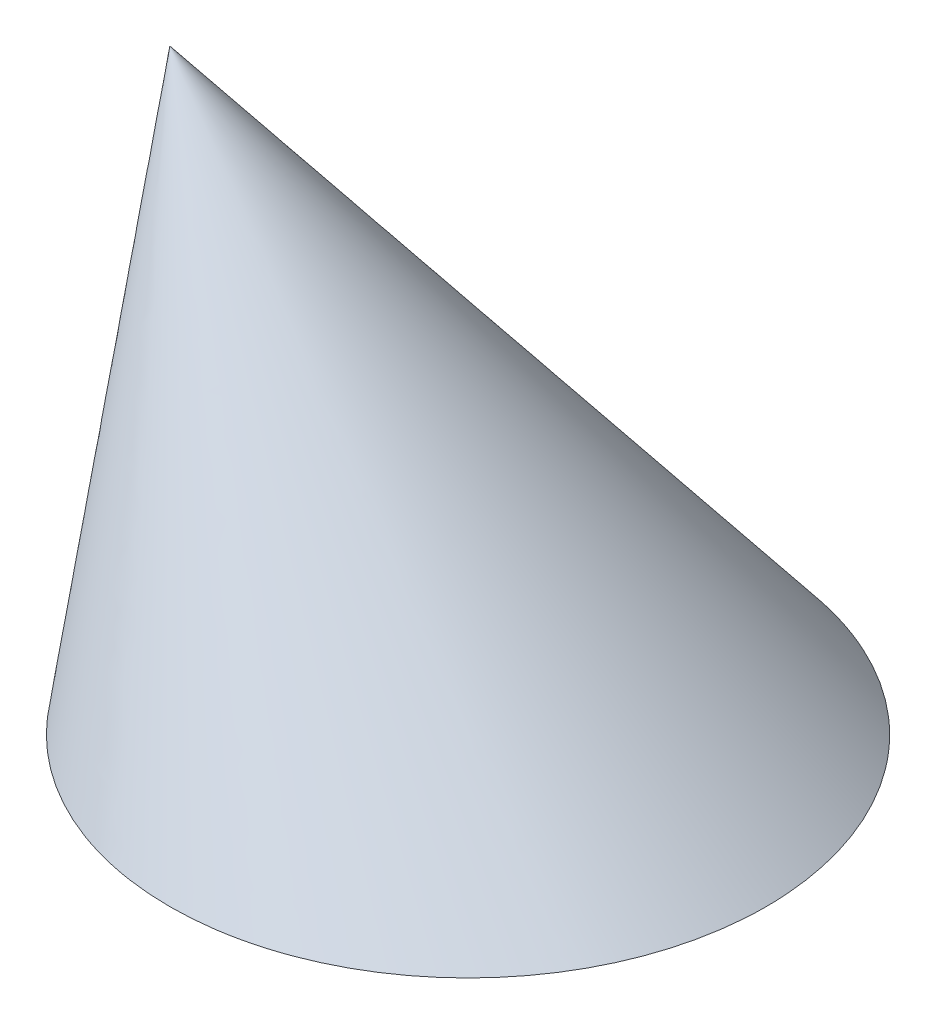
from build123d import *

# Parameters (mm, degrees)
SKETCH_1_R = 1000


with BuildPart() as part:
    # Sketch 1 → Loft 1 section 0
    with BuildSketch(Plane(origin=(0, 0, 0), x_dir=(1, 0, 0), z_dir=(0, 1, 0)), mode=Mode.PRIVATE) as loft_1_s0:
        Circle(SKETCH_1_R)
    loft([loft_1_s0.sketch, Vertex(-1000, 1500, 0)])


solid = part.part
